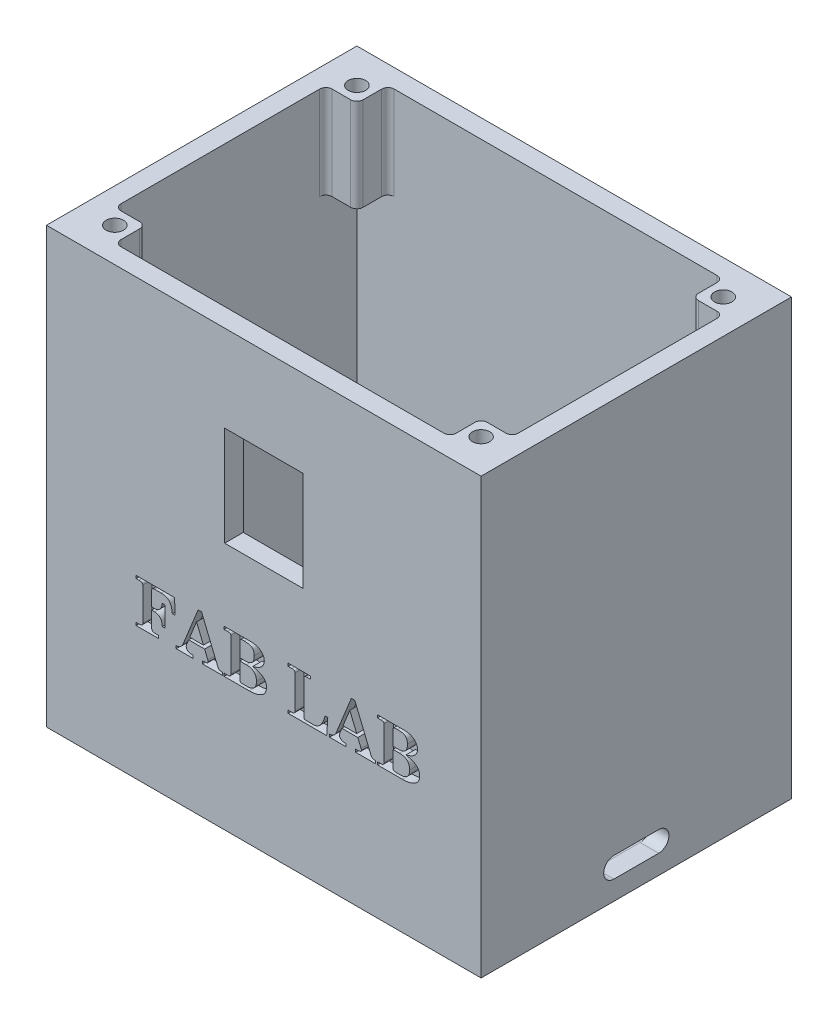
from build123d import *

# Parameters (mm, degrees)
SKETCH1_W           = 70
SKETCH1_H           = 50
BOSS_EXTRUDE1_DEPTH = 70
SKETCH2_W           = 64
SKETCH2_H           = 44
CUT_EXTRUDE1_DEPTH  = 67
SKETCH3_W           = 12.6
SKETCH3_H           = 16.05
CUT_EXTRUDE2_DEPTH  = 5
SKETCH4_R           = 3
SKETCH4_W           = 12
SKETCH4_H           = 17.5
CUT_EXTRUDE3_DEPTH  = 5
CUT_EXTRUDE4_DEPTH  = 5
SKETCH6_W           = 5
SKETCH6_H           = 5
SKETCH6_R           = 1.4
BOSS_EXTRUDE2_DEPTH = 15
FILLET1_R           = 1
CUT_EXTRUDE5_DEPTH  = 1.5


with BuildPart() as part:
    # Sketch1 → Boss-Extrude1 (new body)
    with BuildSketch(Plane(origin=(0, 0, 0), x_dir=(1, 0, 0), z_dir=(0, 1, 0))):
        Rectangle(SKETCH1_W, SKETCH1_H)
    extrude(amount=BOSS_EXTRUDE1_DEPTH)

    # Sketch2 → Cut-Extrude1 (cut)
    with BuildSketch(Plane(origin=(0, 70, 0), x_dir=(1, 0, 0), z_dir=(0, 1, 0))):
        Rectangle(SKETCH2_W, SKETCH2_H)
    extrude(amount=-CUT_EXTRUDE1_DEPTH, mode=Mode.SUBTRACT)

    # Sketch3 → Cut-Extrude2 (cut)
    with BuildSketch(Plane.XY.offset(25)):
        with Locations((0, 48.025)):
            Rectangle(SKETCH3_W, SKETCH3_H)
    extrude(amount=-CUT_EXTRUDE2_DEPTH, mode=Mode.SUBTRACT)

    # Sketch4 → Cut-Extrude3 (cut)
    with BuildSketch(Plane(origin=(0, 0, -25), x_dir=(-1, 0, 0), z_dir=(0, 0, -1))):
        with Locations((5, 8)):
            Circle(SKETCH4_R)
        with Locations((24, 13.75)):
            Rectangle(SKETCH4_W, SKETCH4_H)
    extrude(amount=-CUT_EXTRUDE3_DEPTH, mode=Mode.SUBTRACT)

    # Sketch5 → Cut-Extrude4 (cut)
    with BuildSketch(Plane(origin=(35, 0, 0), x_dir=(0, 0, -1), z_dir=(1, 0, 0))):
        with BuildLine():
            Line((-3.6, 6.4), (3.6, 6.4))
            ThreePointArc((3.6, 6.4), (5.25, 4.75), (3.6, 3.1))
            Line((3.6, 3.1), (-3.6, 3.1))
            ThreePointArc((-3.6, 3.1), (-5.25, 4.75), (-3.6, 6.4))
        make_face()
    extrude(amount=-CUT_EXTRUDE4_DEPTH, mode=Mode.SUBTRACT)

    # Sketch6 → Boss-Extrude2 (add)
    # profile 1 of 4: a face of its own
    with BuildSketch(Plane(origin=(0, 70, 0), x_dir=(1, 0, 0), z_dir=(0, 1, 0))):
        with Locations((-29.5, -19.5)):
            Rectangle(SKETCH6_W, SKETCH6_H)
        with Locations(Location((-29.5, -19.5, 0), (0, 0, 90))):
            Circle(SKETCH6_R, mode=Mode.SUBTRACT)
    # profile 2 of 4: a face of its own
    with BuildSketch(Plane(origin=(0, 70, 0), x_dir=(1, 0, 0), z_dir=(0, 1, 0))):
        with Locations((-29.5, 19.5)):
            Rectangle(SKETCH6_W, SKETCH6_H)
        with Locations(Location((-29.5, 19.5, 0), (0, 0, 270))):
            Circle(SKETCH6_R, mode=Mode.SUBTRACT)
    # profile 3 of 4: a face of its own
    with BuildSketch(Plane(origin=(0, 70, 0), x_dir=(1, 0, 0), z_dir=(0, 1, 0))):
        with Locations((29.5, 19.5)):
            Rectangle(SKETCH6_W, SKETCH6_H)
        with Locations(Location((29.5, 19.5, 0), (0, 0, 90))):
            Circle(SKETCH6_R, mode=Mode.SUBTRACT)
    # profile 4 of 4: a face of its own
    with BuildSketch(Plane(origin=(0, 70, 0), x_dir=(1, 0, 0), z_dir=(0, 1, 0))):
        with Locations((29.5, -19.5)):
            Rectangle(SKETCH6_W, SKETCH6_H)
        with Locations(Location((29.5, -19.5, 0), (0, 0, 270))):
            Circle(SKETCH6_R, mode=Mode.SUBTRACT)
    extrude(amount=-BOSS_EXTRUDE2_DEPTH)

    # Fillet1
    fillet1_edges = [part.edges().sort_by_distance(p)[0] for p in [
        (-27, 62.5, -22),
        (-27, 62.5, -17),
        (-32, 62.5, -17),
        (32, 62.5, -17),
        (27, 62.5, -17),
        (27, 62.5, -22),
        (-32, 62.5, 17),
        (-27, 62.5, 17),
        (-27, 62.5, 22),
        (27, 62.5, 22),
        (27, 62.5, 17),
        (32, 62.5, 17),
    ]]
    fillet(fillet1_edges, radius=FILLET1_R)

    # Sketch7 → Cut-Extrude5 (cut)
    # profile 1 of 6: a face of its own
    with BuildSketch(Plane.XY.offset(25)):
        with BuildLine():
            Line((-20.562584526, 28.379363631), (-14.370276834, 28.379363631))
            Line((-14.370276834, 28.379363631), (-14.280533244, 25.956286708))
            Line((-14.280533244, 25.956286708), (-14.729251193, 25.956286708))
            add(Edge.make_bspline(
                [(-14.729251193, 25.956286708), (-14.739465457, 26.04617428), (-14.759113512, 26.219081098), (-14.803568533, 26.466422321), (-14.853588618, 26.692826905), (-14.917276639, 26.896819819), (-14.988480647, 27.079787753), (-15.067173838, 27.242787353), (-15.159104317, 27.38246438), (-15.260063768, 27.502817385), (-15.372943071, 27.60602782), (-15.499933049, 27.692769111), (-15.6410549, 27.765987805), (-15.794692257, 27.828077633), (-15.963888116, 27.873605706), (-16.146256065, 27.907235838), (-16.343289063, 27.926533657), (-16.479209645, 27.929245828), (-16.549363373, 27.930645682)],
                knots=[0, 0, 0, 0, 1.421064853, 2.733545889, 3.946788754, 5.061805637, 6.087397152, 7.03003638, 7.899823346, 8.707587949, 9.492595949, 10.29523609, 11.116509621, 11.986606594, 12.893551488, 13.86443471, 14.89775439, 16, 16, 16, 16], degree=3))
            Line((-16.549363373, 27.930645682), (-17.605252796, 27.930645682))
            add(Edge.make_bspline(
                [(-17.605252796, 27.930645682), (-17.641339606, 27.929875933), (-17.708909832, 27.928434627), (-17.802614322, 27.910119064), (-17.881520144, 27.881265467), (-17.945629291, 27.840177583), (-17.993343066, 27.786407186), (-18.026272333, 27.722218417), (-18.045803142, 27.648520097), (-18.048409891, 27.596098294), (-18.049764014, 27.568866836)],
                knots=[0, 0, 0, 0, 1.320170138, 2.47193352, 3.479951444, 4.382232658, 5.231109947, 6.081195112, 7.003241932, 8, 8, 8, 8], degree=3))
            Line((-18.049764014, 27.568866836), (-18.049764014, 25.23833799))
            Line((-18.049764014, 25.23833799), (-17.666951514, 25.23833799))
            add(Edge.make_bspline(
                [(-17.666951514, 25.23833799), (-17.620639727, 25.239501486), (-17.53009117, 25.241776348), (-17.397641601, 25.257022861), (-17.272903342, 25.283792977), (-17.155129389, 25.319946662), (-17.045552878, 25.368285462), (-16.942306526, 25.425303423), (-16.848200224, 25.494710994), (-16.761556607, 25.574049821), (-16.683251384, 25.664364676), (-16.61111685, 25.764625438), (-16.546912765, 25.875484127), (-16.490265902, 25.996922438), (-16.443832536, 26.129453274), (-16.400857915, 26.271286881), (-16.367444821, 26.424167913), (-16.352365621, 26.530159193), (-16.344635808, 26.584491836)],
                knots=[0, 0, 0, 0, 1.057301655, 2.067230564, 3.038360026, 3.966501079, 4.874486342, 5.767932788, 6.653699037, 7.537341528, 8.444825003, 9.377677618, 10.353194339, 11.365319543, 12.432003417, 13.556325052, 14.747337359, 16, 16, 16, 16], degree=3))
            Line((-16.344635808, 26.584491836), (-15.89591786, 26.584491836))
            Line((-15.89591786, 26.584491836), (-15.89591786, 23.353722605))
            Line((-15.89591786, 23.353722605), (-16.344635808, 23.353722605))
            add(Edge.make_bspline(
                [(-16.344635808, 23.353722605), (-16.349179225, 23.434742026), (-16.357782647, 23.588160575), (-16.393475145, 23.803978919), (-16.441858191, 23.994112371), (-16.511469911, 24.158102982), (-16.597736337, 24.29938761), (-16.696398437, 24.42449196), (-16.810637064, 24.533178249), (-16.939426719, 24.624315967), (-17.079372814, 24.700233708), (-17.232866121, 24.750804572), (-17.395719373, 24.785246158), (-17.508308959, 24.788138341), (-17.565989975, 24.789620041)],
                knots=[0, 0, 0, 0, 1.37699167, 2.607474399, 3.708761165, 4.70093188, 5.619753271, 6.512246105, 7.399287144, 8.286896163, 9.185193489, 10.091311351, 11.022155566, 12, 12, 12, 12], degree=3))
            Line((-17.565989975, 24.789620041), (-18.049764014, 24.789620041))
            Line((-18.049764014, 24.789620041), (-18.049764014, 22.259972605))
            add(Edge.make_bspline(
                [(-18.049764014, 22.259972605), (-18.04831656, 22.228561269), (-18.045588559, 22.169360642), (-18.028249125, 22.086706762), (-17.996411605, 22.016451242), (-17.963357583, 21.981144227), (-17.947400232, 21.964099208)],
                knots=[0, 0, 0, 0, 1.170848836, 2.20668691, 3.134249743, 4, 4, 4, 4], degree=3))
            add(Edge.make_bspline(
                [(-17.947400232, 21.964099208), (-17.922358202, 21.943508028), (-17.872877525, 21.90282181), (-17.787749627, 21.859060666), (-17.695177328, 21.832487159), (-17.631142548, 21.829576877), (-17.598241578, 21.828081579)],
                knots=[0, 0, 0, 0, 1.012187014, 1.999985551, 2.972395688, 4, 4, 4, 4], degree=3))
            Line((-17.598241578, 21.828081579), (-16.972840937, 21.828081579))
            Line((-16.972840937, 21.828081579), (-16.972840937, 21.379363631))
            Line((-16.972840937, 21.379363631), (-20.562584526, 21.379363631))
            Line((-20.562584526, 21.379363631), (-20.562584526, 21.828081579))
            Line((-20.562584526, 21.828081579), (-19.941390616, 21.828081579))
            add(Edge.make_bspline(
                [(-19.941390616, 21.828081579), (-19.906615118, 21.829018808), (-19.840908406, 21.830789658), (-19.749323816, 21.854888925), (-19.668529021, 21.888425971), (-19.603241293, 21.940927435), (-19.551324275, 22.002719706), (-19.512118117, 22.072834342), (-19.489259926, 22.151064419), (-19.486874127, 22.205606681), (-19.48566145, 22.233329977)],
                knots=[0, 0, 0, 0, 1.211400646, 2.288886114, 3.290542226, 4.244593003, 5.183565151, 6.097339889, 7.032896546, 8, 8, 8, 8], degree=3))
            Line((-19.48566145, 22.233329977), (-19.48566145, 27.567464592))
            add(Edge.make_bspline(
                [(-19.48566145, 27.567464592), (-19.486639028, 27.598947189), (-19.488464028, 27.657720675), (-19.51114902, 27.738394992), (-19.547963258, 27.804257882), (-19.602824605, 27.856570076), (-19.682395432, 27.89145962), (-19.787728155, 27.915159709), (-19.923364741, 27.927319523), (-20.023638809, 27.929465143), (-20.078810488, 27.930645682)],
                knots=[0, 0, 0, 0, 0.934183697, 1.743986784, 2.466613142, 3.155125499, 3.957373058, 5.016298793, 6.358341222, 8, 8, 8, 8], degree=3))
            Line((-20.078810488, 27.930645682), (-20.562584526, 27.930645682))
            Line((-20.562584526, 27.930645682), (-20.562584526, 28.379363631))
        make_face()
    # profile 2 of 6: a face of its own
    with BuildSketch(Plane.XY.offset(25)):
        with BuildLine():
            Line((-10.019114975, 28.55885081), (-7.431975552, 22.273995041))
            add(Edge.make_bspline(
                [(-7.431975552, 22.273995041), (-7.414920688, 22.233937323), (-7.383187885, 22.159404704), (-7.328459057, 22.059775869), (-7.271614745, 21.98046347), (-7.210940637, 21.919108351), (-7.141834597, 21.876918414), (-7.064724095, 21.849954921), (-6.979091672, 21.830229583), (-6.918416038, 21.828821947), (-6.886502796, 21.828081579)],
                knots=[0, 0, 0, 0, 1.370087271, 2.549226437, 3.57052343, 4.434214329, 5.246883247, 6.094249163, 6.997642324, 8, 8, 8, 8], degree=3))
            Line((-6.886502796, 21.828081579), (-6.652328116, 21.828081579))
            Line((-6.652328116, 21.828081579), (-6.652328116, 21.379363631))
            Line((-6.652328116, 21.379363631), (-9.883097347, 21.379363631))
            Line((-9.883097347, 21.379363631), (-9.883097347, 21.828081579))
            Line((-9.883097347, 21.828081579), (-9.580212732, 21.828081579))
            add(Edge.make_bspline(
                [(-9.580212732, 21.828081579), (-9.525045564, 21.829272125), (-9.424314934, 21.831445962), (-9.286349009, 21.843741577), (-9.176575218, 21.868300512), (-9.090424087, 21.900777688), (-9.029691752, 21.946915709), (-8.984051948, 21.995682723), (-8.956505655, 22.053694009), (-8.953523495, 22.094698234), (-8.952007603, 22.115541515)],
                knots=[0, 0, 0, 0, 1.734001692, 3.166141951, 4.34179556, 5.263658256, 6.030315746, 6.716978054, 7.34781383, 8, 8, 8, 8], degree=3))
            add(Edge.make_bspline(
                [(-8.952007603, 22.115541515), (-8.955062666, 22.152835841), (-8.961757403, 22.234561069), (-8.991776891, 22.31097651), (-9.008097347, 22.352520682)],
                knots=[0, 0, 0, 0, 0.912675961, 2, 2, 2, 2], degree=3))
            Line((-9.008097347, 22.352520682), (-9.529731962, 23.622953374))
            Line((-9.529731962, 23.622953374), (-12.100044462, 23.622953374))
            Line((-12.100044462, 23.622953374), (-12.335621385, 23.043826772))
            add(Edge.make_bspline(
                [(-12.335621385, 23.043826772), (-12.359269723, 22.98754376), (-12.402796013, 22.883951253), (-12.452288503, 22.737517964), (-12.484972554, 22.614275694), (-12.490316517, 22.538690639), (-12.492672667, 22.505365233)],
                knots=[0, 0, 0, 0, 1.298659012, 2.390265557, 3.29026905, 4, 4, 4, 4], degree=3))
            add(Edge.make_bspline(
                [(-12.492672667, 22.505365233), (-12.49025515, 22.45732805), (-12.48552528, 22.363343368), (-12.440123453, 22.230237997), (-12.366498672, 22.111511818), (-12.2635524, 22.010601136), (-12.137340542, 21.927194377), (-11.986827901, 21.870574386), (-11.817721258, 21.832839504), (-11.697361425, 21.829713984), (-11.634499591, 21.828081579)],
                knots=[0, 0, 0, 0, 0.936681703, 1.832616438, 2.715165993, 3.645764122, 4.629294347, 5.650980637, 6.773148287, 8, 8, 8, 8], degree=3))
            Line((-11.634499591, 21.828081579), (-11.408738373, 21.828081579))
            Line((-11.408738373, 21.828081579), (-11.408738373, 21.379363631))
            Line((-11.408738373, 21.379363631), (-14.101046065, 21.379363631))
            Line((-14.101046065, 21.379363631), (-14.101046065, 21.828081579))
            Line((-14.101046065, 21.828081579), (-13.939788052, 21.828081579))
            add(Edge.make_bspline(
                [(-13.939788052, 21.828081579), (-13.895663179, 21.829852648), (-13.809187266, 21.833323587), (-13.68418545, 21.864109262), (-13.566823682, 21.91276228), (-13.497787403, 21.960895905), (-13.463025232, 21.985132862)],
                knots=[0, 0, 0, 0, 1.034931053, 2.028257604, 3.007159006, 4, 4, 4, 4], degree=3))
            add(Edge.make_bspline(
                [(-13.463025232, 21.985132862), (-13.416184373, 22.02375086), (-13.32256393, 22.100936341), (-13.200146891, 22.237353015), (-13.094016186, 22.38905578), (-13.038232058, 22.499931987), (-13.010100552, 22.555846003)],
                knots=[0, 0, 0, 0, 0.989267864, 1.977241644, 2.979938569, 4, 4, 4, 4], degree=3))
            Line((-13.010100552, 22.555846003), (-10.57580568, 28.55885081))
            Line((-10.57580568, 28.55885081), (-10.019114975, 28.55885081))
        make_face()
        Polygon((-10.825405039, 26.768185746), (-11.919155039, 24.071671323), (-9.714828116, 24.071671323), align=None, mode=Mode.SUBTRACT)
    # profile 3 of 6: a face of its own
    with BuildSketch(Plane.XY.offset(25)):
        with BuildLine():
            Line((-6.383097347, 28.379363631), (-2.076807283, 28.379363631))
            add(Edge.make_bspline(
                [(-2.076807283, 28.379363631), (-1.995419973, 28.378214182), (-1.836525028, 28.375970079), (-1.605103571, 28.352827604), (-1.387119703, 28.316900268), (-1.182376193, 28.266694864), (-0.990738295, 28.200792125), (-0.812343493, 28.11942933), (-0.647273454, 28.023899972), (-0.497152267, 27.914491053), (-0.363217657, 27.793874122), (-0.244200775, 27.666930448), (-0.145572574, 27.530627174), (-0.063293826, 27.388645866), (0.00040414, 27.238875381), (0.044903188, 27.081487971), (0.074474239, 26.917467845), (0.077109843, 26.805241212), (0.078441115, 26.748554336)],
                knots=[0, 0, 0, 0, 1.291697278, 2.521820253, 3.688064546, 4.796700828, 5.864451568, 6.900479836, 7.904660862, 8.887223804, 9.843631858, 10.762604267, 11.644237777, 12.508493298, 13.363009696, 14.220228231, 15.101018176, 16, 16, 16, 16], degree=3))
            add(Edge.make_bspline(
                [(0.078441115, 26.748554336), (0.077297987, 26.698443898), (0.075053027, 26.600033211), (0.051179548, 26.455408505), (0.015290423, 26.31665673), (-0.035479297, 26.183263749), (-0.102300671, 26.056857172), (-0.182007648, 25.935205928), (-0.279220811, 25.821638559), (-0.388102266, 25.711879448), (-0.512936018, 25.609171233), (-0.65228512, 25.512234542), (-0.80668456, 25.422189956), (-0.974375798, 25.335056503), (-1.15836101, 25.258697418), (-1.354940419, 25.182967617), (-1.567338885, 25.116170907), (-1.714859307, 25.077395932), (-1.790749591, 25.057448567)],
                knots=[0, 0, 0, 0, 0.879296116, 1.726828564, 2.567054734, 3.393331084, 4.226793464, 5.073729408, 5.941881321, 6.847378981, 7.785946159, 8.776523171, 9.825351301, 10.923056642, 12.092538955, 13.321360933, 14.622003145, 16, 16, 16, 16], degree=3))
            add(Edge.make_bspline(
                [(-1.790749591, 25.057448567), (-1.693385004, 25.039965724), (-1.505394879, 25.006210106), (-1.234967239, 24.945127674), (-0.987182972, 24.873389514), (-0.760488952, 24.795754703), (-0.55602143, 24.708791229), (-0.37354533, 24.613742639), (-0.211399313, 24.51152849), (-0.071959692, 24.398687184), (0.048290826, 24.277975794), (0.15296182, 24.151788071), (0.240858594, 24.017187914), (0.311950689, 23.875323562), (0.369461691, 23.726797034), (0.407975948, 23.56983738), (0.43243263, 23.405905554), (0.435741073, 23.293981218), (0.437415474, 23.237336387)],
                knots=[0, 0, 0, 0, 1.498324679, 2.892943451, 4.197105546, 5.403988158, 6.520514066, 7.559240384, 8.517673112, 9.418851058, 10.269937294, 11.094883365, 11.898061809, 12.699146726, 13.494674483, 14.30518407, 15.142254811, 16, 16, 16, 16], degree=3))
            add(Edge.make_bspline(
                [(0.437415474, 23.237336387), (0.436412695, 23.186800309), (0.434447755, 23.08777504), (0.416742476, 22.942007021), (0.389726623, 22.80134063), (0.34754326, 22.666480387), (0.298694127, 22.535358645), (0.233514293, 22.411929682), (0.161859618, 22.291181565), (0.103612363, 22.217305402), (0.074234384, 22.180044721)],
                knots=[0, 0, 0, 0, 1.062618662, 2.082197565, 3.084901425, 4.070931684, 5.051456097, 6.023265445, 7.003000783, 8, 8, 8, 8], degree=3))
            add(Edge.make_bspline(
                [(0.074234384, 22.180044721), (0.051348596, 22.153867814), (0.003837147, 22.099523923), (-0.079503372, 22.024710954), (-0.173851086, 21.95113497), (-0.281120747, 21.881774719), (-0.399354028, 21.812719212), (-0.529761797, 21.74539793), (-0.672789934, 21.681493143), (-0.881539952, 21.597699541), (-1.164369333, 21.507476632), (-1.530459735, 21.432732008), (-1.925180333, 21.387903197), (-2.198212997, 21.382269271), (-2.339026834, 21.379363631)],
                knots=[0, 0, 0, 0, 0.479101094, 0.994625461, 1.541283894, 2.127653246, 2.754465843, 3.429036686, 4.150249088, 4.913878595, 6.530379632, 8.235679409, 10.058589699, 12, 12, 12, 12], degree=3))
            Line((-2.339026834, 21.379363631), (-6.383097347, 21.379363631))
            Line((-6.383097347, 21.379363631), (-6.383097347, 21.828081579))
            Line((-6.383097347, 21.828081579), (-5.695997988, 21.828081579))
            add(Edge.make_bspline(
                [(-5.695997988, 21.828081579), (-5.667763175, 21.828654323), (-5.614696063, 21.829730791), (-5.541419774, 21.851002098), (-5.477108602, 21.880638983), (-5.444291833, 21.912156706), (-5.428169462, 21.927640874)],
                knots=[0, 0, 0, 0, 1.146916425, 2.155620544, 3.093884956, 4, 4, 4, 4], degree=3))
            add(Edge.make_bspline(
                [(-5.428169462, 21.927640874), (-5.409338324, 21.950796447), (-5.372099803, 21.996586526), (-5.335162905, 22.077059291), (-5.309056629, 22.16251691), (-5.307149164, 22.222370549), (-5.30617427, 22.252961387)],
                knots=[0, 0, 0, 0, 1.004255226, 1.985911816, 2.970611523, 4, 4, 4, 4], degree=3))
            Line((-5.30617427, 22.252961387), (-5.30617427, 27.657208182))
            add(Edge.make_bspline(
                [(-5.30617427, 27.657208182), (-5.307533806, 27.676537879), (-5.310238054, 27.714986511), (-5.331861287, 27.770123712), (-5.370514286, 27.816757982), (-5.421096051, 27.859052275), (-5.489350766, 27.893025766), (-5.576513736, 27.91553825), (-5.682483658, 27.929085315), (-5.759518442, 27.930098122), (-5.801166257, 27.930645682)],
                knots=[0, 0, 0, 0, 0.733581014, 1.45916341, 2.205321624, 3.012600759, 3.949884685, 5.074569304, 6.418405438, 8, 8, 8, 8], degree=3))
            Line((-5.801166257, 27.930645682), (-6.383097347, 27.930645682))
            Line((-6.383097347, 27.930645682), (-6.383097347, 28.379363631))
        make_face()
        with BuildLine():
            Line((-3.870276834, 25.23833799), (-3.069595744, 25.23833799))
            add(Edge.make_bspline(
                [(-3.069595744, 25.23833799), (-3.003199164, 25.239485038), (-2.875358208, 25.241693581), (-2.691111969, 25.256489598), (-2.52166781, 25.283709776), (-2.36624673, 25.318434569), (-2.225853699, 25.3673413), (-2.098855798, 25.423574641), (-1.987349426, 25.49281036), (-1.889589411, 25.572452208), (-1.805969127, 25.665717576), (-1.732584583, 25.77082687), (-1.672619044, 25.890817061), (-1.621377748, 26.022882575), (-1.584852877, 26.170080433), (-1.556629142, 26.330251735), (-1.539944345, 26.504214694), (-1.537965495, 26.624653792), (-1.536943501, 26.686855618)],
                knots=[0, 0, 0, 0, 1.299882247, 2.502812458, 3.614547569, 4.657741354, 5.615573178, 6.520545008, 7.371194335, 8.177267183, 8.980530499, 9.815633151, 10.679129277, 11.600195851, 12.583392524, 13.642477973, 14.782437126, 16, 16, 16, 16], degree=3))
            add(Edge.make_bspline(
                [(-1.536943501, 26.686855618), (-1.538070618, 26.74111135), (-1.540242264, 26.845647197), (-1.555344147, 26.996271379), (-1.581684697, 27.134876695), (-1.619570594, 27.261142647), (-1.666636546, 27.376163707), (-1.726541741, 27.477833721), (-1.795034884, 27.568996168), (-1.877164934, 27.647565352), (-1.973232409, 27.716849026), (-2.088816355, 27.773587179), (-2.222506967, 27.821978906), (-2.375330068, 27.862973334), (-2.54723483, 27.89229628), (-2.738187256, 27.914678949), (-2.94785576, 27.928838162), (-3.094345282, 27.93002712), (-3.170557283, 27.930645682)],
                knots=[0, 0, 0, 0, 1.086683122, 2.09373899, 3.028338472, 3.908054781, 4.730507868, 5.510907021, 6.265553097, 7.007135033, 7.778780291, 8.628749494, 9.57661958, 10.623576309, 11.793426, 13.066195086, 14.473671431, 16, 16, 16, 16], degree=3))
            add(Edge.make_bspline(
                [(-3.170557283, 27.930645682), (-3.207022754, 27.930450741), (-3.276240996, 27.930080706), (-3.37439296, 27.925374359), (-3.461909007, 27.920367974), (-3.53915672, 27.912098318), (-3.606622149, 27.901084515), (-3.664064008, 27.887719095), (-3.710589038, 27.87106226), (-3.758511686, 27.847033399), (-3.804999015, 27.804756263), (-3.843919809, 27.73781563), (-3.867733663, 27.655034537), (-3.869391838, 27.59428088), (-3.870276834, 27.561855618)],
                knots=[0, 0, 0, 0, 1.434003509, 2.722005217, 3.864130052, 4.881201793, 5.775764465, 6.551568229, 7.19707598, 7.715076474, 8.652436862, 9.617158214, 10.728236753, 12, 12, 12, 12], degree=3))
            Line((-3.870276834, 27.561855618), (-3.870276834, 25.23833799))
        make_face(mode=Mode.SUBTRACT)
        with BuildLine():
            Line((-3.870276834, 24.789620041), (-3.870276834, 22.236134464))
            add(Edge.make_bspline(
                [(-3.870276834, 22.236134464), (-3.869214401, 22.20475464), (-3.867217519, 22.145775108), (-3.852191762, 22.062740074), (-3.825570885, 21.991202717), (-3.78801945, 21.931102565), (-3.738943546, 21.885520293), (-3.682674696, 21.852043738), (-3.618232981, 21.832082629), (-3.572673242, 21.829443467), (-3.549163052, 21.828081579)],
                knots=[0, 0, 0, 0, 1.281771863, 2.409137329, 3.430599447, 4.384107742, 5.27575193, 6.140401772, 7.04039163, 8, 8, 8, 8], degree=3))
            Line((-3.549163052, 21.828081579), (-2.627889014, 21.828081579))
            add(Edge.make_bspline(
                [(-2.627889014, 21.828081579), (-2.572700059, 21.829147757), (-2.465323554, 21.831222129), (-2.308917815, 21.847593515), (-2.162496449, 21.877995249), (-2.02383123, 21.916133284), (-1.895235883, 21.9687894), (-1.774376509, 22.029889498), (-1.664592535, 22.105440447), (-1.563178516, 22.190997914), (-1.471447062, 22.287679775), (-1.392794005, 22.39639093), (-1.326492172, 22.515655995), (-1.271363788, 22.645220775), (-1.230145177, 22.786136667), (-1.198958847, 22.93704839), (-1.180713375, 23.09853147), (-1.178899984, 23.20971249), (-1.177969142, 23.266783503)],
                knots=[0, 0, 0, 0, 1.138755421, 2.215580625, 3.238898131, 4.221924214, 5.178329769, 6.101476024, 7.011018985, 7.921175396, 8.835461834, 9.75375843, 10.682129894, 11.645899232, 12.652859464, 13.706454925, 14.822686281, 16, 16, 16, 16], degree=3))
            add(Edge.make_bspline(
                [(-1.177969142, 23.266783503), (-1.179485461, 23.326656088), (-1.182430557, 23.442944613), (-1.200334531, 23.612411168), (-1.231986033, 23.771367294), (-1.279013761, 23.918844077), (-1.335791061, 24.056481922), (-1.40797398, 24.181904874), (-1.49303966, 24.296349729), (-1.589528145, 24.400868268), (-1.700192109, 24.491958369), (-1.821108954, 24.572460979), (-1.954220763, 24.640329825), (-2.099454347, 24.694254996), (-2.255530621, 24.738091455), (-2.423578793, 24.768505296), (-2.603165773, 24.786932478), (-2.726934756, 24.788707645), (-2.79054927, 24.789620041)],
                knots=[0, 0, 0, 0, 1.135228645, 2.204916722, 3.22688037, 4.202287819, 5.135559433, 6.044617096, 6.937944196, 7.834605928, 8.734415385, 9.648770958, 10.584144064, 11.560195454, 12.581544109, 13.6540186, 14.794217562, 16, 16, 16, 16], degree=3))
            Line((-2.79054927, 24.789620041), (-3.870276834, 24.789620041))
        make_face(mode=Mode.SUBTRACT)
    # profile 4 of 6: a face of its own
    with BuildSketch(Plane.XY.offset(25)):
        with BuildLine():
            Line((3.937415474, 27.930645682), (3.937415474, 28.379363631))
            Line((3.937415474, 28.379363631), (7.527159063, 28.379363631))
            Line((7.527159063, 28.379363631), (7.527159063, 27.930645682))
            Line((7.527159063, 27.930645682), (6.919987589, 27.930645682))
            add(Edge.make_bspline(
                [(6.919987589, 27.930645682), (6.879664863, 27.930094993), (6.804988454, 27.929075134), (6.702615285, 27.908721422), (6.617965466, 27.879921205), (6.551797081, 27.834563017), (6.505615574, 27.773425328), (6.472834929, 27.699161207), (6.453909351, 27.609514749), (6.451515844, 27.544654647), (6.450235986, 27.509972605)],
                knots=[0, 0, 0, 0, 1.317174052, 2.439364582, 3.40274332, 4.226216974, 5.021934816, 5.877883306, 6.86526021, 8, 8, 8, 8], degree=3))
            Line((6.450235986, 27.509972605), (6.450235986, 22.318866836))
            add(Edge.make_bspline(
                [(6.450235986, 22.318866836), (6.450745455, 22.271096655), (6.451670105, 22.184397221), (6.471137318, 22.068168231), (6.499685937, 21.978239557), (6.546475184, 21.909127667), (6.625335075, 21.870303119), (6.72885309, 21.846758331), (6.865299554, 21.830137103), (6.967145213, 21.828815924), (7.023753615, 21.828081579)],
                knots=[0, 0, 0, 0, 1.253318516, 2.274682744, 3.08242206, 3.723352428, 4.399534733, 5.325689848, 6.513550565, 8, 8, 8, 8], degree=3))
            Line((7.023753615, 21.828081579), (8.043184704, 21.828081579))
            add(Edge.make_bspline(
                [(8.043184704, 21.828081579), (8.090502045, 21.829763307), (8.184795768, 21.833114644), (8.324365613, 21.85821814), (8.46197212, 21.896641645), (8.595088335, 21.956308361), (8.728036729, 22.02713995), (8.856913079, 22.116617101), (8.983854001, 22.221333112), (9.108491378, 22.341516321), (9.228598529, 22.479718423), (9.340630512, 22.637836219), (9.445739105, 22.815271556), (9.543380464, 23.011942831), (9.63420078, 23.227027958), (9.718991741, 23.460753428), (9.793568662, 23.714598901), (9.837751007, 23.891086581), (9.860492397, 23.981927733)],
                knots=[0, 0, 0, 0, 0.746952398, 1.488522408, 2.233867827, 2.997739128, 3.787258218, 4.610437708, 5.470623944, 6.384302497, 7.342016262, 8.35813022, 9.440650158, 10.596202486, 11.823439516, 13.126538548, 14.520981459, 16, 16, 16, 16], degree=3))
            Line((9.860492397, 23.981927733), (10.309210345, 23.981927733))
            Line((10.309210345, 23.981927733), (10.129723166, 21.379363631))
            Line((10.129723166, 21.379363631), (3.937415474, 21.379363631))
            Line((3.937415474, 21.379363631), (3.937415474, 21.828081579))
            Line((3.937415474, 21.828081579), (4.582447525, 21.828081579))
            add(Edge.make_bspline(
                [(4.582447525, 21.828081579), (4.615720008, 21.829441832), (4.679161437, 21.832035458), (4.767851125, 21.850833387), (4.843494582, 21.884091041), (4.907008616, 21.928922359), (4.954834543, 21.988390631), (4.991508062, 22.05697689), (5.010364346, 22.137950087), (5.012967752, 22.194919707), (5.01433855, 22.224916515)],
                knots=[0, 0, 0, 0, 1.195528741, 2.279542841, 3.234602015, 4.14844858, 5.043106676, 5.952155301, 6.921726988, 8, 8, 8, 8], degree=3))
            Line((5.01433855, 22.224916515), (5.01433855, 27.561855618))
            add(Edge.make_bspline(
                [(5.01433855, 27.561855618), (5.01315919, 27.591902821), (5.010932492, 27.648633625), (4.990120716, 27.727437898), (4.954252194, 27.793295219), (4.902532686, 27.846206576), (4.833631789, 27.886595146), (4.745095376, 27.91144326), (4.638246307, 27.928239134), (4.560095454, 27.929802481), (4.51794432, 27.930645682)],
                knots=[0, 0, 0, 0, 1.00990991, 1.906766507, 2.716615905, 3.506507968, 4.367174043, 5.37229384, 6.582730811, 8, 8, 8, 8], degree=3))
            Line((4.51794432, 27.930645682), (3.937415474, 27.930645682))
        make_face()
    # profile 5 of 6: a face of its own
    with BuildSketch(Plane.XY.offset(25)):
        with BuildLine():
            Line((14.660372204, 28.55885081), (17.247511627, 22.273995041))
            add(Edge.make_bspline(
                [(17.247511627, 22.273995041), (17.264566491, 22.233937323), (17.296299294, 22.159404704), (17.351028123, 22.059775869), (17.407872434, 21.98046347), (17.468546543, 21.919108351), (17.537652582, 21.876918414), (17.614763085, 21.849954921), (17.700395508, 21.830229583), (17.761071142, 21.828821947), (17.792984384, 21.828081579)],
                knots=[0, 0, 0, 0, 1.370087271, 2.549226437, 3.57052343, 4.434214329, 5.246883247, 6.094249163, 6.997642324, 8, 8, 8, 8], degree=3))
            Line((17.792984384, 21.828081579), (18.027159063, 21.828081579))
            Line((18.027159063, 21.828081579), (18.027159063, 21.379363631))
            Line((18.027159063, 21.379363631), (14.796389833, 21.379363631))
            Line((14.796389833, 21.379363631), (14.796389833, 21.828081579))
            Line((14.796389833, 21.828081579), (15.099274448, 21.828081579))
            add(Edge.make_bspline(
                [(15.099274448, 21.828081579), (15.154441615, 21.829272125), (15.255172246, 21.831445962), (15.39313817, 21.843741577), (15.502911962, 21.868300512), (15.589063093, 21.900777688), (15.649795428, 21.946915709), (15.695435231, 21.995682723), (15.722981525, 22.053694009), (15.725963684, 22.094698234), (15.727479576, 22.115541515)],
                knots=[0, 0, 0, 0, 1.734001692, 3.166141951, 4.34179556, 5.263658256, 6.030315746, 6.716978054, 7.34781383, 8, 8, 8, 8], degree=3))
            add(Edge.make_bspline(
                [(15.727479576, 22.115541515), (15.724424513, 22.152835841), (15.717729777, 22.234561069), (15.687710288, 22.31097651), (15.671389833, 22.352520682)],
                knots=[0, 0, 0, 0, 0.912675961, 2, 2, 2, 2], degree=3))
            Line((15.671389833, 22.352520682), (15.149755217, 23.622953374))
            Line((15.149755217, 23.622953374), (12.579442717, 23.622953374))
            Line((12.579442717, 23.622953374), (12.343865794, 23.043826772))
            add(Edge.make_bspline(
                [(12.343865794, 23.043826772), (12.320217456, 22.98754376), (12.276691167, 22.883951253), (12.227198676, 22.737517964), (12.194514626, 22.614275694), (12.189170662, 22.538690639), (12.186814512, 22.505365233)],
                knots=[0, 0, 0, 0, 1.298659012, 2.390265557, 3.29026905, 4, 4, 4, 4], degree=3))
            add(Edge.make_bspline(
                [(12.186814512, 22.505365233), (12.18923203, 22.45732805), (12.193961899, 22.363343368), (12.239363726, 22.230237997), (12.312988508, 22.111511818), (12.41593478, 22.010601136), (12.542146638, 21.927194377), (12.692659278, 21.870574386), (12.861765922, 21.832839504), (12.982125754, 21.829713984), (13.044987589, 21.828081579)],
                knots=[0, 0, 0, 0, 0.936681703, 1.832616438, 2.715165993, 3.645764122, 4.629294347, 5.650980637, 6.773148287, 8, 8, 8, 8], degree=3))
            Line((13.044987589, 21.828081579), (13.270748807, 21.828081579))
            Line((13.270748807, 21.828081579), (13.270748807, 21.379363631))
            Line((13.270748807, 21.379363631), (10.578441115, 21.379363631))
            Line((10.578441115, 21.379363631), (10.578441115, 21.828081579))
            Line((10.578441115, 21.828081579), (10.739699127, 21.828081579))
            add(Edge.make_bspline(
                [(10.739699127, 21.828081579), (10.783824, 21.829852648), (10.870299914, 21.833323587), (10.99530173, 21.864109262), (11.112663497, 21.91276228), (11.181699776, 21.960895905), (11.216461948, 21.985132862)],
                knots=[0, 0, 0, 0, 1.034931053, 2.028257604, 3.007159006, 4, 4, 4, 4], degree=3))
            add(Edge.make_bspline(
                [(11.216461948, 21.985132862), (11.263302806, 22.02375086), (11.35692325, 22.100936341), (11.479340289, 22.237353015), (11.585470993, 22.38905578), (11.641255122, 22.499931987), (11.669386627, 22.555846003)],
                knots=[0, 0, 0, 0, 0.989267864, 1.977241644, 2.979938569, 4, 4, 4, 4], degree=3))
            Line((11.669386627, 22.555846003), (14.103681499, 28.55885081))
            Line((14.103681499, 28.55885081), (14.660372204, 28.55885081))
        make_face()
        Polygon((13.85408214, 26.768185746), (12.76033214, 24.071671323), (14.964659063, 24.071671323), align=None, mode=Mode.SUBTRACT)
    # profile 6 of 6: a face of its own
    with BuildSketch(Plane.XY.offset(25)):
        with BuildLine():
            Line((18.296389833, 28.379363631), (22.602679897, 28.379363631))
            add(Edge.make_bspline(
                [(22.602679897, 28.379363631), (22.684067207, 28.378214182), (22.842962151, 28.375970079), (23.074383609, 28.352827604), (23.292367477, 28.316900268), (23.497110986, 28.266694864), (23.688748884, 28.200792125), (23.867143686, 28.11942933), (24.032213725, 28.023899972), (24.182334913, 27.914491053), (24.316269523, 27.793874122), (24.435286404, 27.666930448), (24.533914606, 27.530627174), (24.616193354, 27.388645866), (24.679891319, 27.238875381), (24.724390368, 27.081487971), (24.753961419, 26.917467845), (24.756597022, 26.805241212), (24.757928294, 26.748554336)],
                knots=[0, 0, 0, 0, 1.291697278, 2.521820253, 3.688064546, 4.796700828, 5.864451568, 6.900479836, 7.904660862, 8.887223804, 9.843631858, 10.762604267, 11.644237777, 12.508493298, 13.363009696, 14.220228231, 15.101018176, 16, 16, 16, 16], degree=3))
            add(Edge.make_bspline(
                [(24.757928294, 26.748554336), (24.756785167, 26.698443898), (24.754540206, 26.600033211), (24.730666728, 26.455408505), (24.694777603, 26.31665673), (24.644007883, 26.183263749), (24.577186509, 26.056857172), (24.497479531, 25.935205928), (24.400266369, 25.821638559), (24.291384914, 25.711879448), (24.166551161, 25.609171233), (24.02720206, 25.512234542), (23.872802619, 25.422189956), (23.705111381, 25.335056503), (23.52112617, 25.258697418), (23.324546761, 25.182967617), (23.112148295, 25.116170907), (22.964627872, 25.077395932), (22.888737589, 25.057448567)],
                knots=[0, 0, 0, 0, 0.879296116, 1.726828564, 2.567054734, 3.393331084, 4.226793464, 5.073729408, 5.941881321, 6.847378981, 7.785946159, 8.776523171, 9.825351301, 10.923056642, 12.092538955, 13.321360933, 14.622003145, 16, 16, 16, 16], degree=3))
            add(Edge.make_bspline(
                [(22.888737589, 25.057448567), (22.986102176, 25.039965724), (23.1740923, 25.006210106), (23.444519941, 24.945127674), (23.692304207, 24.873389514), (23.918998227, 24.795754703), (24.12346575, 24.708791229), (24.305941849, 24.613742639), (24.468087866, 24.51152849), (24.607527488, 24.398687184), (24.727778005, 24.277975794), (24.832449, 24.151788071), (24.920345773, 24.017187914), (24.991437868, 23.875323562), (25.04894887, 23.726797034), (25.087463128, 23.56983738), (25.11191981, 23.405905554), (25.115228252, 23.293981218), (25.116902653, 23.237336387)],
                knots=[0, 0, 0, 0, 1.498324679, 2.892943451, 4.197105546, 5.403988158, 6.520514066, 7.559240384, 8.517673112, 9.418851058, 10.269937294, 11.094883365, 11.898061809, 12.699146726, 13.494674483, 14.30518407, 15.142254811, 16, 16, 16, 16], degree=3))
            add(Edge.make_bspline(
                [(25.116902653, 23.237336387), (25.115899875, 23.186800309), (25.113934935, 23.08777504), (25.096229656, 22.942007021), (25.069213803, 22.80134063), (25.02703044, 22.666480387), (24.978181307, 22.535358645), (24.913001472, 22.411929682), (24.841346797, 22.291181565), (24.783099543, 22.217305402), (24.753721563, 22.180044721)],
                knots=[0, 0, 0, 0, 1.062618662, 2.082197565, 3.084901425, 4.070931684, 5.051456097, 6.023265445, 7.003000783, 8, 8, 8, 8], degree=3))
            add(Edge.make_bspline(
                [(24.753721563, 22.180044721), (24.730835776, 22.153867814), (24.683324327, 22.099523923), (24.599983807, 22.024710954), (24.505636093, 21.95113497), (24.398366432, 21.881774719), (24.280133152, 21.812719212), (24.149725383, 21.74539793), (24.006697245, 21.681493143), (23.797947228, 21.597699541), (23.515117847, 21.507476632), (23.149027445, 21.432732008), (22.754306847, 21.387903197), (22.481274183, 21.382269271), (22.340460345, 21.379363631)],
                knots=[0, 0, 0, 0, 0.479101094, 0.994625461, 1.541283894, 2.127653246, 2.754465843, 3.429036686, 4.150249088, 4.913878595, 6.530379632, 8.235679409, 10.058589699, 12, 12, 12, 12], degree=3))
            Line((22.340460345, 21.379363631), (18.296389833, 21.379363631))
            Line((18.296389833, 21.379363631), (18.296389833, 21.828081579))
            Line((18.296389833, 21.828081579), (18.983489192, 21.828081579))
            add(Edge.make_bspline(
                [(18.983489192, 21.828081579), (19.011724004, 21.828654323), (19.064791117, 21.829730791), (19.138067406, 21.851002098), (19.202378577, 21.880638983), (19.235195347, 21.912156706), (19.251317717, 21.927640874)],
                knots=[0, 0, 0, 0, 1.146916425, 2.155620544, 3.093884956, 4, 4, 4, 4], degree=3))
            add(Edge.make_bspline(
                [(19.251317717, 21.927640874), (19.270148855, 21.950796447), (19.307387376, 21.996586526), (19.344324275, 22.077059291), (19.37043055, 22.16251691), (19.372338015, 22.222370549), (19.373312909, 22.252961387)],
                knots=[0, 0, 0, 0, 1.004255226, 1.985911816, 2.970611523, 4, 4, 4, 4], degree=3))
            Line((19.373312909, 22.252961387), (19.373312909, 27.657208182))
            add(Edge.make_bspline(
                [(19.373312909, 27.657208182), (19.371953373, 27.676537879), (19.369249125, 27.714986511), (19.347625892, 27.770123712), (19.308972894, 27.816757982), (19.258391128, 27.859052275), (19.190136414, 27.893025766), (19.102973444, 27.91553825), (18.997003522, 27.929085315), (18.919968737, 27.930098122), (18.878320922, 27.930645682)],
                knots=[0, 0, 0, 0, 0.733581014, 1.45916341, 2.205321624, 3.012600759, 3.949884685, 5.074569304, 6.418405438, 8, 8, 8, 8], degree=3))
            Line((18.878320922, 27.930645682), (18.296389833, 27.930645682))
            Line((18.296389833, 27.930645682), (18.296389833, 28.379363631))
        make_face()
        with BuildLine():
            Line((20.809210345, 25.23833799), (21.609891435, 25.23833799))
            add(Edge.make_bspline(
                [(21.609891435, 25.23833799), (21.676288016, 25.239485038), (21.804128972, 25.241693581), (21.98837521, 25.256489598), (22.157819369, 25.283709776), (22.313240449, 25.318434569), (22.45363348, 25.3673413), (22.580631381, 25.423574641), (22.692137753, 25.49281036), (22.789897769, 25.572452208), (22.873518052, 25.665717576), (22.946902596, 25.77082687), (23.006868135, 25.890817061), (23.058109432, 26.022882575), (23.094634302, 26.170080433), (23.122858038, 26.330251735), (23.139542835, 26.504214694), (23.141521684, 26.624653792), (23.142543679, 26.686855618)],
                knots=[0, 0, 0, 0, 1.299882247, 2.502812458, 3.614547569, 4.657741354, 5.615573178, 6.520545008, 7.371194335, 8.177267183, 8.980530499, 9.815633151, 10.679129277, 11.600195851, 12.583392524, 13.642477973, 14.782437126, 16, 16, 16, 16], degree=3))
            add(Edge.make_bspline(
                [(23.142543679, 26.686855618), (23.141416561, 26.74111135), (23.139244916, 26.845647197), (23.124143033, 26.996271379), (23.097802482, 27.134876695), (23.059916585, 27.261142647), (23.012850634, 27.376163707), (22.952945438, 27.477833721), (22.884452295, 27.568996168), (22.802322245, 27.647565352), (22.706254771, 27.716849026), (22.590670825, 27.773587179), (22.456980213, 27.821978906), (22.304157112, 27.862973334), (22.132252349, 27.89229628), (21.941299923, 27.914678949), (21.731631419, 27.928838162), (21.585141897, 27.93002712), (21.508929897, 27.930645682)],
                knots=[0, 0, 0, 0, 1.086683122, 2.09373899, 3.028338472, 3.908054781, 4.730507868, 5.510907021, 6.265553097, 7.007135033, 7.778780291, 8.628749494, 9.57661958, 10.623576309, 11.793426, 13.066195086, 14.473671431, 16, 16, 16, 16], degree=3))
            add(Edge.make_bspline(
                [(21.508929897, 27.930645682), (21.472464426, 27.930450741), (21.403246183, 27.930080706), (21.305094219, 27.925374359), (21.217578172, 27.920367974), (21.14033046, 27.912098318), (21.07286503, 27.901084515), (21.015423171, 27.887719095), (20.968898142, 27.87106226), (20.920975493, 27.847033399), (20.874488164, 27.804756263), (20.835567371, 27.73781563), (20.811753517, 27.655034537), (20.810095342, 27.59428088), (20.809210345, 27.561855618)],
                knots=[0, 0, 0, 0, 1.434003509, 2.722005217, 3.864130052, 4.881201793, 5.775764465, 6.551568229, 7.19707598, 7.715076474, 8.652436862, 9.617158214, 10.728236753, 12, 12, 12, 12], degree=3))
            Line((20.809210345, 27.561855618), (20.809210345, 25.23833799))
        make_face(mode=Mode.SUBTRACT)
        with BuildLine():
            Line((20.809210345, 24.789620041), (20.809210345, 22.236134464))
            add(Edge.make_bspline(
                [(20.809210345, 22.236134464), (20.810272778, 22.20475464), (20.81226966, 22.145775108), (20.827295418, 22.062740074), (20.853916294, 21.991202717), (20.891467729, 21.931102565), (20.940543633, 21.885520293), (20.996812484, 21.852043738), (21.061254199, 21.832082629), (21.106813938, 21.829443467), (21.130324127, 21.828081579)],
                knots=[0, 0, 0, 0, 1.281771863, 2.409137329, 3.430599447, 4.384107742, 5.27575193, 6.140401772, 7.04039163, 8, 8, 8, 8], degree=3))
            Line((21.130324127, 21.828081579), (22.051598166, 21.828081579))
            add(Edge.make_bspline(
                [(22.051598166, 21.828081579), (22.10678712, 21.829147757), (22.214163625, 21.831222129), (22.370569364, 21.847593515), (22.516990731, 21.877995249), (22.65565595, 21.916133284), (22.784251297, 21.9687894), (22.905110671, 22.029889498), (23.014894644, 22.105440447), (23.116308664, 22.190997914), (23.208040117, 22.287679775), (23.286693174, 22.39639093), (23.352995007, 22.515655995), (23.408123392, 22.645220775), (23.449342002, 22.786136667), (23.480528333, 22.93704839), (23.498773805, 23.09853147), (23.500587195, 23.20971249), (23.501518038, 23.266783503)],
                knots=[0, 0, 0, 0, 1.138755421, 2.215580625, 3.238898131, 4.221924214, 5.178329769, 6.101476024, 7.011018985, 7.921175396, 8.835461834, 9.75375843, 10.682129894, 11.645899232, 12.652859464, 13.706454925, 14.822686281, 16, 16, 16, 16], degree=3))
            add(Edge.make_bspline(
                [(23.501518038, 23.266783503), (23.500001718, 23.326656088), (23.497056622, 23.442944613), (23.479152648, 23.612411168), (23.447501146, 23.771367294), (23.400473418, 23.918844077), (23.343696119, 24.056481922), (23.271513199, 24.181904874), (23.18644752, 24.296349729), (23.089959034, 24.400868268), (22.97929507, 24.491958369), (22.858378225, 24.572460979), (22.725266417, 24.640329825), (22.580032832, 24.694254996), (22.423956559, 24.738091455), (22.255908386, 24.768505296), (22.076321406, 24.786932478), (21.952552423, 24.788707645), (21.888937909, 24.789620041)],
                knots=[0, 0, 0, 0, 1.135228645, 2.204916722, 3.22688037, 4.202287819, 5.135559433, 6.044617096, 6.937944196, 7.834605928, 8.734415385, 9.648770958, 10.584144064, 11.560195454, 12.581544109, 13.6540186, 14.794217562, 16, 16, 16, 16], degree=3))
            Line((21.888937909, 24.789620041), (20.809210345, 24.789620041))
        make_face(mode=Mode.SUBTRACT)
    extrude(amount=-CUT_EXTRUDE5_DEPTH, mode=Mode.SUBTRACT)


solid = part.part
